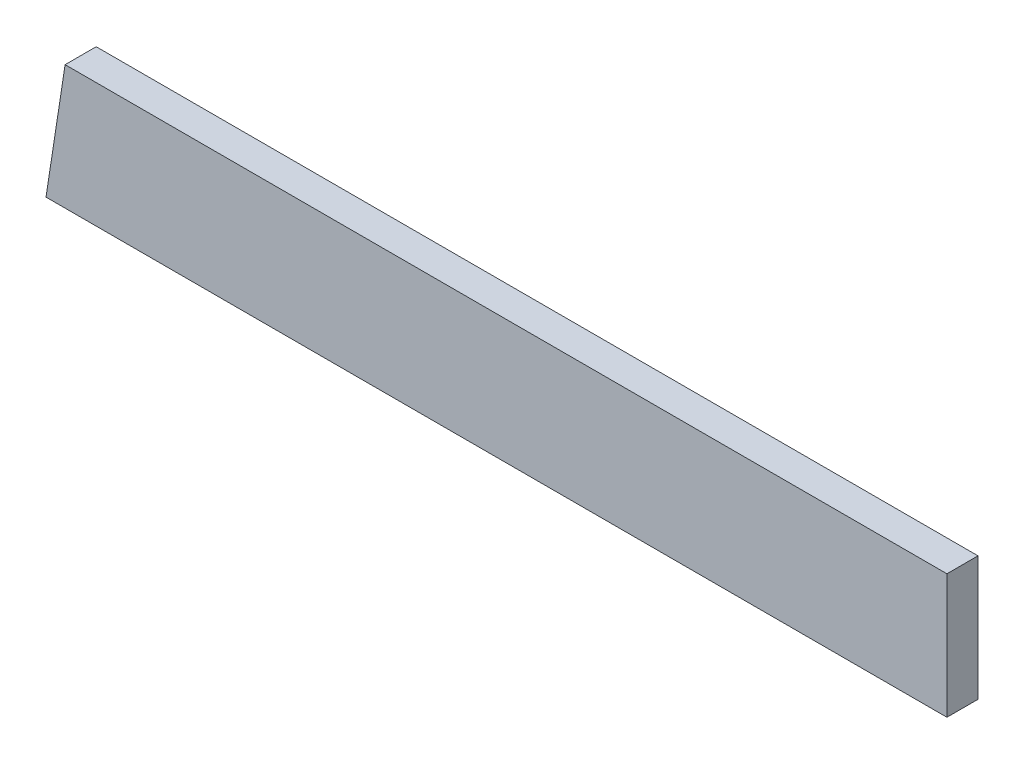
from build123d import *

# Parameters (mm, degrees)
BOSS_EXTRUDE1_DEPTH = 25.4


with BuildPart() as part:
    # Sketch2 → Boss-Extrude1 (new body)
    with BuildSketch(Plane.XY):
        Polygon((-1117.6, -1371.6), (-381.117230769, -1371.6), (-381.117230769, -1270), (-1101.969230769, -1270), align=None)
    extrude(amount=BOSS_EXTRUDE1_DEPTH)


solid = part.part
